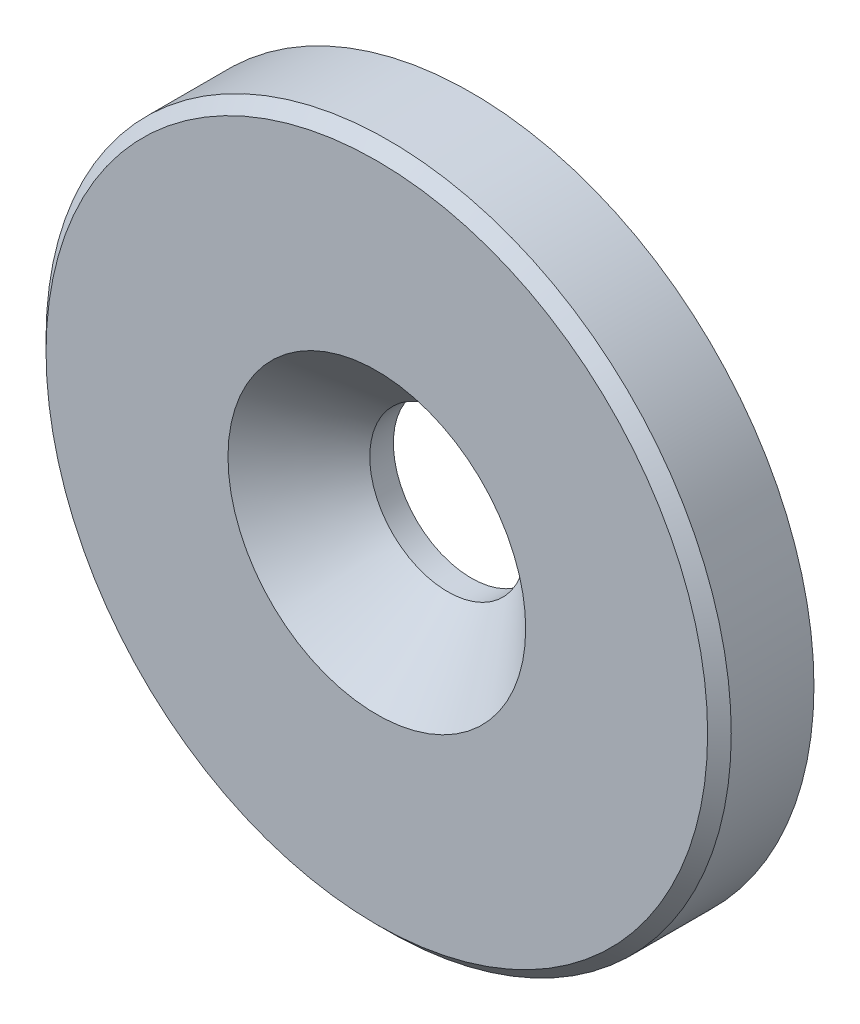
from build123d import *

# Parameters (mm, degrees)
ESQUISSE1_R          = 14.5
BASE_EXTRUSION_DEPTH = 4
CHANFREIN1_SIZE      = 0.5


with BuildPart() as part:
    # Esquisse1 → Base-Extrusion (new body)
    with BuildSketch(Plane.XY):
        Circle(ESQUISSE1_R)
    extrude(amount=BASE_EXTRUSION_DEPTH)

    # Esquisse2 → Per_age1 (revolve, cut)
    with BuildSketch(Plane(origin=(0, 0, 4), x_dir=(0, -1, 0), z_dir=(1, 0, 0))):
        Polygon((0, 0), (0, 5.982840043), (3.3, 4), (3.3, 3), (6.3, 0), align=None)
    revolve(axis=Axis((0, 0, 18.308894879), (0, 0, -1)), mode=Mode.SUBTRACT)

    # Chanfrein1
    chanfrein1_edges = [part.edges().sort_by_distance(p)[0] for p in [
        (-14.5, 0, 4),
    ]]
    chamfer(chanfrein1_edges, length=CHANFREIN1_SIZE)


solid = part.part
